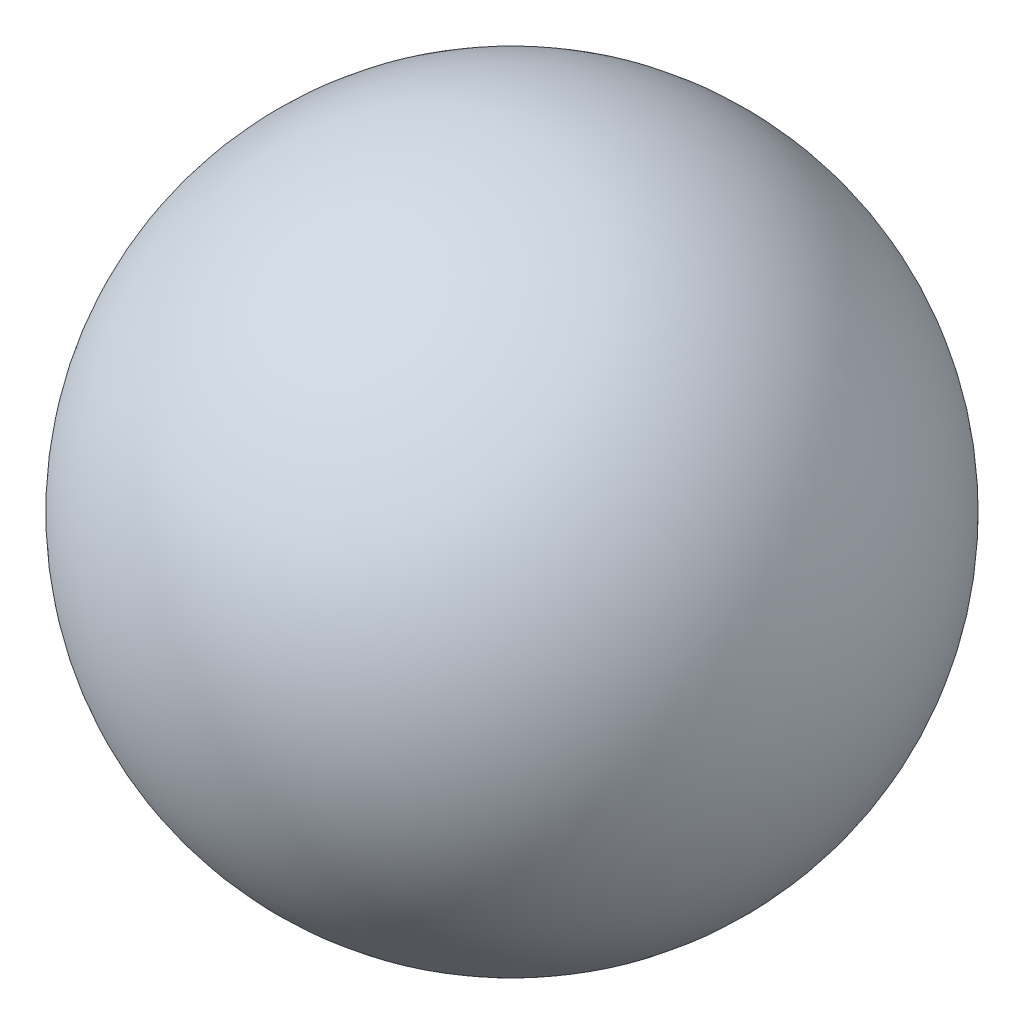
ISO-10303-21;
HEADER;
FILE_DESCRIPTION(('STEP AP214'),'2;1');
FILE_NAME('part.step','',(''),(''),'','','');
FILE_SCHEMA(('AUTOMOTIVE_DESIGN { 1 0 10303 214 1 1 1 1 }'));
ENDSEC;
DATA;
#1=APPLICATION_CONTEXT('core data for automotive mechanical design processes');
#2=APPLICATION_PROTOCOL_DEFINITION('international standard','automotive_design',2000,#1);
#3=PRODUCT_CONTEXT('',#1,'mechanical');
#4=PRODUCT('Part','Part','',(#3));
#5=PRODUCT_RELATED_PRODUCT_CATEGORY('part','',(#4));
#6=PRODUCT_DEFINITION_FORMATION('','',#4);
#7=PRODUCT_DEFINITION_CONTEXT('part definition',#1,'design');
#8=PRODUCT_DEFINITION('design','',#6,#7);
#9=PRODUCT_DEFINITION_SHAPE('','',#8);
#10=(LENGTH_UNIT() NAMED_UNIT(*) SI_UNIT(.MILLI.,.METRE.));
#11=(NAMED_UNIT(*) PLANE_ANGLE_UNIT() SI_UNIT($,.RADIAN.));
#12=(NAMED_UNIT(*) SI_UNIT($,.STERADIAN.) SOLID_ANGLE_UNIT());
#13=UNCERTAINTY_MEASURE_WITH_UNIT(LENGTH_MEASURE(1.E-05),#10,'distance_accuracy_value','');
#14=(GEOMETRIC_REPRESENTATION_CONTEXT(3) GLOBAL_UNCERTAINTY_ASSIGNED_CONTEXT((#13)) GLOBAL_UNIT_ASSIGNED_CONTEXT((#10,
#11,#12)) REPRESENTATION_CONTEXT('',''));
#15=CARTESIAN_POINT('',(0.,0.,0.));
#16=DIRECTION('',(0.,0.,1.));
#17=DIRECTION('',(1.,0.,0.));
#18=AXIS2_PLACEMENT_3D('',#15,#16,#17);
#19=CARTESIAN_POINT('',(0.,0.,0.));
#20=DIRECTION('',(0.,1.,0.));
#21=DIRECTION('',(0.,0.,1.));
#22=AXIS2_PLACEMENT_3D('',#19,#20,#21);
#23=SPHERICAL_SURFACE('',#22,3.175);
#24=CARTESIAN_POINT('',(0.,3.175,0.));
#25=VERTEX_POINT('',#24);
#26=VERTEX_LOOP('',#25);
#27=FACE_BOUND('',#26,.T.);
#28=ADVANCED_FACE('F33',(#27),#23,.T.);
#29=CLOSED_SHELL('',(#28));
#30=MANIFOLD_SOLID_BREP('B2',#29);
#31=ADVANCED_BREP_SHAPE_REPRESENTATION('',(#18,#30),#14);
#32=SHAPE_DEFINITION_REPRESENTATION(#9,#31);
ENDSEC;
END-ISO-10303-21;
